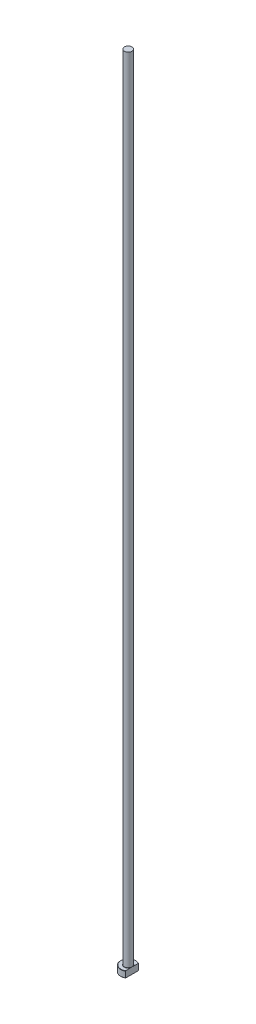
ISO-10303-21;
HEADER;
FILE_DESCRIPTION(('STEP AP214'),'2;1');
FILE_NAME('part.step','',(''),(''),'','','');
FILE_SCHEMA(('AUTOMOTIVE_DESIGN { 1 0 10303 214 1 1 1 1 }'));
ENDSEC;
DATA;
#1=APPLICATION_CONTEXT('core data for automotive mechanical design processes');
#2=APPLICATION_PROTOCOL_DEFINITION('international standard','automotive_design',2000,#1);
#3=PRODUCT_CONTEXT('',#1,'mechanical');
#4=PRODUCT('Part','Part','',(#3));
#5=PRODUCT_RELATED_PRODUCT_CATEGORY('part','',(#4));
#6=PRODUCT_DEFINITION_FORMATION('','',#4);
#7=PRODUCT_DEFINITION_CONTEXT('part definition',#1,'design');
#8=PRODUCT_DEFINITION('design','',#6,#7);
#9=PRODUCT_DEFINITION_SHAPE('','',#8);
#10=(LENGTH_UNIT() NAMED_UNIT(*) SI_UNIT(.MILLI.,.METRE.));
#11=(NAMED_UNIT(*) PLANE_ANGLE_UNIT() SI_UNIT($,.RADIAN.));
#12=(NAMED_UNIT(*) SI_UNIT($,.STERADIAN.) SOLID_ANGLE_UNIT());
#13=UNCERTAINTY_MEASURE_WITH_UNIT(LENGTH_MEASURE(1.E-05),#10,'distance_accuracy_value','');
#14=(GEOMETRIC_REPRESENTATION_CONTEXT(3) GLOBAL_UNCERTAINTY_ASSIGNED_CONTEXT((#13)) GLOBAL_UNIT_ASSIGNED_CONTEXT((#10,
#11,#12)) REPRESENTATION_CONTEXT('',''));
#15=CARTESIAN_POINT('',(0.,0.,0.));
#16=DIRECTION('',(0.,0.,1.));
#17=DIRECTION('',(1.,0.,0.));
#18=AXIS2_PLACEMENT_3D('',#15,#16,#17);
#19=CARTESIAN_POINT('',(0.,0.,0.));
#20=DIRECTION('',(0.,-1.,0.));
#21=DIRECTION('',(0.,0.,-1.));
#22=AXIS2_PLACEMENT_3D('',#19,#20,#21);
#23=PLANE('',#22);
#24=CARTESIAN_POINT('',(0.,0.,0.));
#25=DIRECTION('',(0.,-1.,0.));
#26=DIRECTION('',(0.,0.,-1.));
#27=AXIS2_PLACEMENT_3D('',#24,#25,#26);
#28=CIRCLE('',#27,5.79999999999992);
#29=CARTESIAN_POINT('',(2.99999999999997,0.,4.96386945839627));
#30=VERTEX_POINT('',#29);
#31=CARTESIAN_POINT('',(2.99999999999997,0.,-4.96386945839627));
#32=VERTEX_POINT('',#31);
#33=EDGE_CURVE('E98',#30,#32,#28,.T.);
#34=ORIENTED_EDGE('',*,*,#33,.T.);
#35=DIRECTION('',(0.,0.,1.));
#36=VECTOR('',#35,1.);
#37=CARTESIAN_POINT('',(2.99999999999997,0.,-5.19615242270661));
#38=LINE('',#37,#36);
#39=EDGE_CURVE('E83',#32,#30,#38,.T.);
#40=ORIENTED_EDGE('',*,*,#39,.T.);
#41=EDGE_LOOP('',(#34,#40));
#42=FACE_BOUND('',#41,.T.);
#43=ADVANCED_FACE('F32',(#42),#23,.T.);
#44=CARTESIAN_POINT('',(0.,259.958771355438,0.));
#45=DIRECTION('',(0.,1.,0.));
#46=DIRECTION('',(0.,0.,1.));
#47=AXIS2_PLACEMENT_3D('',#44,#45,#46);
#48=CYLINDRICAL_SURFACE('',#47,5.99999999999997);
#49=CARTESIAN_POINT('',(0.,4.80000000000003,0.));
#50=DIRECTION('',(0.,1.,0.));
#51=DIRECTION('',(0.,0.,1.));
#52=AXIS2_PLACEMENT_3D('',#49,#50,#51);
#53=CIRCLE('',#52,5.99999999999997);
#54=CARTESIAN_POINT('',(2.99999999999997,4.80000000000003,5.19615242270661));
#55=VERTEX_POINT('',#54);
#56=CARTESIAN_POINT('',(2.99999999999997,4.80000000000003,-5.19615242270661));
#57=VERTEX_POINT('',#56);
#58=EDGE_CURVE('E104',#55,#57,#53,.F.);
#59=ORIENTED_EDGE('',*,*,#58,.T.);
#60=DIRECTION('',(0.,-1.,0.));
#61=VECTOR('',#60,1.);
#62=CARTESIAN_POINT('',(2.99999999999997,630.,-5.19615242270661));
#63=LINE('',#62,#61);
#64=CARTESIAN_POINT('',(2.99999999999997,0.200000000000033,-5.19615242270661));
#65=VERTEX_POINT('',#64);
#66=EDGE_CURVE('E183',#57,#65,#63,.T.);
#67=ORIENTED_EDGE('',*,*,#66,.T.);
#68=CARTESIAN_POINT('',(0.,0.200000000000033,0.));
#69=DIRECTION('',(0.,-1.,0.));
#70=DIRECTION('',(0.,0.,-1.));
#71=AXIS2_PLACEMENT_3D('',#68,#69,#70);
#72=CIRCLE('',#71,5.99999999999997);
#73=CARTESIAN_POINT('',(2.99999999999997,0.200000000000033,5.19615242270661));
#74=VERTEX_POINT('',#73);
#75=EDGE_CURVE('E100',#65,#74,#72,.F.);
#76=ORIENTED_EDGE('',*,*,#75,.T.);
#77=DIRECTION('',(0.,-1.,0.));
#78=VECTOR('',#77,1.);
#79=CARTESIAN_POINT('',(2.99999999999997,630.,5.19615242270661));
#80=LINE('',#79,#78);
#81=EDGE_CURVE('E93',#55,#74,#80,.T.);
#82=ORIENTED_EDGE('',*,*,#81,.F.);
#83=EDGE_LOOP('',(#59,#67,#76,#82));
#84=FACE_BOUND('',#83,.T.);
#85=ADVANCED_FACE('F158',(#84),#48,.T.);
#86=CARTESIAN_POINT('',(-5.99999999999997,5.,0.));
#87=DIRECTION('',(0.,1.,0.));
#88=DIRECTION('',(0.,0.,1.));
#89=AXIS2_PLACEMENT_3D('',#86,#87,#88);
#90=PLANE('',#89);
#91=CARTESIAN_POINT('',(0.,5.,0.));
#92=DIRECTION('',(0.,1.,0.));
#93=DIRECTION('',(0.,0.,1.));
#94=AXIS2_PLACEMENT_3D('',#91,#92,#93);
#95=CIRCLE('',#94,5.79999999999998);
#96=CARTESIAN_POINT('',(2.99999999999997,5.,-4.96386945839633));
#97=VERTEX_POINT('',#96);
#98=CARTESIAN_POINT('',(2.99999999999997,5.,4.96386945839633));
#99=VERTEX_POINT('',#98);
#100=EDGE_CURVE('E178',#97,#99,#95,.T.);
#101=ORIENTED_EDGE('',*,*,#100,.T.);
#102=DIRECTION('',(0.,0.,-1.));
#103=VECTOR('',#102,1.);
#104=CARTESIAN_POINT('',(2.99999999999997,5.,0.));
#105=LINE('',#104,#103);
#106=CARTESIAN_POINT('',(2.99999999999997,4.99999999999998,1.11355287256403));
#107=VERTEX_POINT('',#106);
#108=EDGE_CURVE('E57',#99,#107,#105,.T.);
#109=ORIENTED_EDGE('',*,*,#108,.T.);
#110=CARTESIAN_POINT('',(0.,5.,0.));
#111=DIRECTION('',(0.,1.,0.));
#112=DIRECTION('',(0.,0.,1.));
#113=AXIS2_PLACEMENT_3D('',#110,#111,#112);
#114=CIRCLE('',#113,3.19999999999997);
#115=CARTESIAN_POINT('',(2.99999999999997,4.99999999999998,-1.113552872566));
#116=VERTEX_POINT('',#115);
#117=EDGE_CURVE('E107',#107,#116,#114,.F.);
#118=ORIENTED_EDGE('',*,*,#117,.T.);
#119=EDGE_CURVE('E136',#116,#97,#105,.T.);
#120=ORIENTED_EDGE('',*,*,#119,.T.);
#121=EDGE_LOOP('',(#101,#109,#118,#120));
#122=FACE_BOUND('',#121,.T.);
#123=ADVANCED_FACE('F147',(#122),#90,.T.);
#124=CARTESIAN_POINT('',(0.,5.,0.));
#125=DIRECTION('',(0.,-1.,0.));
#126=DIRECTION('',(0.,0.,-1.));
#127=AXIS2_PLACEMENT_3D('',#124,#125,#126);
#128=CONICAL_SURFACE('',#127,5.79999999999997,0.785398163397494);
#129=ORIENTED_EDGE('',*,*,#58,.F.);
#130=CARTESIAN_POINT('',(2.99999999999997,-1.01993959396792,11.432889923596));
#131=CARTESIAN_POINT('',(2.99999999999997,-0.769424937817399,11.1738796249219));
#132=CARTESIAN_POINT('',(2.99999999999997,-0.519179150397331,10.9146084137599));
#133=CARTESIAN_POINT('',(2.99999999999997,-0.0193842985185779,10.395389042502));
#134=CARTESIAN_POINT('',(2.99999999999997,0.230164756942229,10.1354408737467));
#135=CARTESIAN_POINT('',(2.99999999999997,0.728528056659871,9.61458602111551));
#136=CARTESIAN_POINT('',(2.99999999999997,0.977341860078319,9.35367891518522));
#137=CARTESIAN_POINT('',(2.99999999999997,1.47386965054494,8.83082274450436));
#138=CARTESIAN_POINT('',(2.99999999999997,1.72158364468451,8.56887368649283));
#139=CARTESIAN_POINT('',(2.99999999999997,2.21069282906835,8.04884148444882));
#140=CARTESIAN_POINT('',(2.99999999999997,2.4521159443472,7.79078462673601));
#141=CARTESIAN_POINT('',(2.99999999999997,2.93315589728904,7.27299342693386));
#142=CARTESIAN_POINT('',(2.99999999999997,3.17277274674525,7.01325909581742));
#143=CARTESIAN_POINT('',(2.99999999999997,3.64950020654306,6.49159990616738));
#144=CARTESIAN_POINT('',(2.99999999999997,3.88661134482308,6.22967553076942));
#145=CARTESIAN_POINT('',(2.99999999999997,4.35738571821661,5.70275148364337));
#146=CARTESIAN_POINT('',(2.99999999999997,4.59104909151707,5.43775193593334));
#147=CARTESIAN_POINT('',(2.99999999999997,4.96416348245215,5.00636825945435));
#148=CARTESIAN_POINT('',(2.99999999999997,5.1052013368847,4.8413584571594));
#149=CARTESIAN_POINT('',(2.99999999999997,5.38476673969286,4.50919282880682));
#150=CARTESIAN_POINT('',(2.99999999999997,5.52329404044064,4.34203679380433));
#151=CARTESIAN_POINT('',(2.99999999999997,5.79842961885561,4.0031993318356));
#152=CARTESIAN_POINT('',(2.99999999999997,5.93500216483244,3.83148875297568));
#153=CARTESIAN_POINT('',(2.99999999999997,6.20336281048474,3.4844211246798));
#154=CARTESIAN_POINT('',(2.99999999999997,6.33515205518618,3.30906496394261));
#155=CARTESIAN_POINT('',(2.99999999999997,6.5939338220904,2.9507080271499));
#156=CARTESIAN_POINT('',(2.99999999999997,6.72082315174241,2.76763161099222));
#157=CARTESIAN_POINT('',(2.99999999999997,6.90336321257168,2.48771743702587));
#158=CARTESIAN_POINT('',(2.99999999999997,6.96295431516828,2.39345390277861));
#159=CARTESIAN_POINT('',(2.99999999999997,7.07882720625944,2.20292146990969));
#160=CARTESIAN_POINT('',(2.99999999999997,7.13510937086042,2.10665280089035));
#161=CARTESIAN_POINT('',(2.99999999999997,7.24288059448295,1.91297779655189));
#162=CARTESIAN_POINT('',(2.99999999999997,7.29441986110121,1.81559978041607));
#163=CARTESIAN_POINT('',(2.99999999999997,7.39241237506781,1.61833215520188));
#164=CARTESIAN_POINT('',(2.99999999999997,7.43886469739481,1.51844209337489));
#165=CARTESIAN_POINT('',(2.99999999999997,7.56840030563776,1.21511948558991));
#166=CARTESIAN_POINT('',(2.99999999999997,7.64209011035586,1.00730397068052));
#167=CARTESIAN_POINT('',(2.99999999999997,7.72186700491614,0.695731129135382));
#168=CARTESIAN_POINT('',(2.99999999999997,7.74302901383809,0.595791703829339));
#169=CARTESIAN_POINT('',(2.99999999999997,7.77582528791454,0.394325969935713));
#170=CARTESIAN_POINT('',(2.99999999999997,7.78746040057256,0.292799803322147));
#171=CARTESIAN_POINT('',(2.99999999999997,7.80037895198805,0.0893987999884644));
#172=CARTESIAN_POINT('',(2.99999999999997,7.80169449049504,-0.0124739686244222));
#173=CARTESIAN_POINT('',(2.99999999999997,7.79396363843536,-0.215826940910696));
#174=CARTESIAN_POINT('',(2.99999999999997,7.78491639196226,-0.317307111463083));
#175=CARTESIAN_POINT('',(2.99999999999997,7.75721241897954,-0.518039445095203));
#176=CARTESIAN_POINT('',(2.99999999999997,7.73863812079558,-0.61730321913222));
#177=CARTESIAN_POINT('',(2.99999999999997,7.6930395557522,-0.813850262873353));
#178=CARTESIAN_POINT('',(2.99999999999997,7.66601427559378,-0.911133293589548));
#179=CARTESIAN_POINT('',(2.99999999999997,7.60464499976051,-1.10394843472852));
#180=CARTESIAN_POINT('',(2.99999999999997,7.57025976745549,-1.19946724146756));
#181=CARTESIAN_POINT('',(2.99999999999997,7.4955576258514,-1.38810736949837));
#182=CARTESIAN_POINT('',(2.99999999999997,7.45524192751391,-1.48122917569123));
#183=CARTESIAN_POINT('',(2.99999999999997,7.36961028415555,-1.66561491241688));
#184=CARTESIAN_POINT('',(2.99999999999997,7.32427350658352,-1.75686908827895));
#185=CARTESIAN_POINT('',(2.99999999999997,7.22966073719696,-1.93732130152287));
#186=CARTESIAN_POINT('',(2.99999999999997,7.18038388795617,-2.02651888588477));
#187=CARTESIAN_POINT('',(2.99999999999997,7.02771106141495,-2.29153460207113));
#188=CARTESIAN_POINT('',(2.99999999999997,6.91955486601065,-2.46460625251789));
#189=CARTESIAN_POINT('',(2.99999999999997,6.69440299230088,-2.80577028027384));
#190=CARTESIAN_POINT('',(2.99999999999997,6.57737415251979,-2.97384034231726));
#191=CARTESIAN_POINT('',(2.99999999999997,6.33748949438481,-3.30561771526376));
#192=CARTESIAN_POINT('',(2.99999999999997,6.21463662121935,-3.46932716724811));
#193=CARTESIAN_POINT('',(2.99999999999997,5.96308085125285,-3.79561670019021));
#194=CARTESIAN_POINT('',(2.99999999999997,5.83432224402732,-3.95815356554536));
#195=CARTESIAN_POINT('',(2.99999999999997,5.57361365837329,-4.28066737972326));
#196=CARTESIAN_POINT('',(2.99999999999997,5.44166333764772,-4.44064405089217));
#197=CARTESIAN_POINT('',(2.99999999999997,5.17568445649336,-4.75819552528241));
#198=CARTESIAN_POINT('',(2.99999999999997,5.04166171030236,-4.91577521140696));
#199=CARTESIAN_POINT('',(2.99999999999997,4.77176230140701,-5.22934053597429));
#200=CARTESIAN_POINT('',(2.99999999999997,4.63588560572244,-5.38532614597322));
#201=CARTESIAN_POINT('',(2.99999999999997,4.27256222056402,-5.79849838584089));
#202=CARTESIAN_POINT('',(2.99999999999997,4.04384014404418,-6.054562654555));
#203=CARTESIAN_POINT('',(2.99999999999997,3.58360020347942,-6.5641703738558));
#204=CARTESIAN_POINT('',(2.99999999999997,3.35208226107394,-6.81771375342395));
#205=CARTESIAN_POINT('',(2.99999999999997,2.88678846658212,-7.32315936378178));
#206=CARTESIAN_POINT('',(2.99999999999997,2.65301069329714,-7.57505982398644));
#207=CARTESIAN_POINT('',(2.99999999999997,2.18392232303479,-8.07742926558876));
#208=CARTESIAN_POINT('',(2.99999999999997,1.94861172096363,-8.32789824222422));
#209=CARTESIAN_POINT('',(2.99999999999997,1.4865158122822,-8.81743943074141));
#210=CARTESIAN_POINT('',(2.99999999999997,1.25977806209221,-9.05655656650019));
#211=CARTESIAN_POINT('',(2.99999999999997,0.805439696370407,-9.53397105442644));
#212=CARTESIAN_POINT('',(2.99999999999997,0.577839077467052,-9.77226840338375));
#213=CARTESIAN_POINT('',(2.99999999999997,0.122198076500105,-10.2479325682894));
#214=CARTESIAN_POINT('',(2.99999999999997,-0.105841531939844,-10.4853001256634));
#215=CARTESIAN_POINT('',(2.99999999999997,-0.562491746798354,-10.9594816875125));
#216=CARTESIAN_POINT('',(2.99999999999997,-0.791102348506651,-11.1962956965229));
#217=CARTESIAN_POINT('',(2.99999999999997,-1.01993959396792,-11.432889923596));
#218=B_SPLINE_CURVE_WITH_KNOTS('',3,(#130,#131,#132,#133,#134,#135,#136,#137,#138,#139,#140,
#141,#142,#143,#144,#145,#146,#147,#148,#149,#150,#151,#152,#153,#154,#155,#156,#157,#158,#159,
#160,#161,#162,#163,#164,#165,#166,#167,#168,#169,#170,#171,#172,#173,#174,#175,#176,#177,#178,
#179,#180,#181,#182,#183,#184,#185,#186,#187,#188,#189,#190,#191,#192,#193,#194,#195,#196,#197,
#198,#199,#200,#201,#202,#203,#204,#205,#206,#207,#208,#209,#210,#211,#212,#213,#214,#215,#216,
#217),.UNSPECIFIED.,.F.,.F.,(4,2,2,2,2,2,2,2,2,2,2,2,2,2,2,2,2,2,2,2,2,2,2,2,2,2,2,2,2,2,2,2,2,
2,2,2,2,2,2,2,2,2,2,4),(0.,1.08101662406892,2.16204714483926,3.24363027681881,4.32520642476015,
5.3853446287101,6.44547590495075,7.50537917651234,8.56523985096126,9.21643479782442,
9.86769362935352,10.5258323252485,11.1838124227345,11.851781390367,12.1862877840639,
12.5207560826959,12.8511332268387,13.1815703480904,13.8399161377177,14.1460077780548,
14.4520721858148,14.7571841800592,15.0623213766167,15.3648619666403,15.6674388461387,
15.9717575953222,16.2760142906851,16.5815843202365,16.8872210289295,17.4990577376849,
18.1133060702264,18.7272470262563,19.3492675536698,19.9713550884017,20.5919343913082,
21.2125247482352,22.2425132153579,23.2725306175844,24.3035181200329,25.3345090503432,
26.3230827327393,27.3116602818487,28.299135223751,29.286602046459),.UNSPECIFIED.);
#219=EDGE_CURVE('E135',#55,#99,#218,.T.);
#220=ORIENTED_EDGE('',*,*,#219,.T.);
#221=ORIENTED_EDGE('',*,*,#100,.F.);
#222=EDGE_CURVE('E127',#97,#57,#218,.T.);
#223=ORIENTED_EDGE('',*,*,#222,.T.);
#224=EDGE_LOOP('',(#129,#220,#221,#223));
#225=FACE_BOUND('',#224,.T.);
#226=ADVANCED_FACE('F143',(#225),#128,.T.);
#227=CARTESIAN_POINT('',(0.,0.200000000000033,0.));
#228=DIRECTION('',(0.,1.,0.));
#229=DIRECTION('',(0.,0.,1.));
#230=AXIS2_PLACEMENT_3D('',#227,#228,#229);
#231=CONICAL_SURFACE('',#230,5.99999999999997,0.785398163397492);
#232=ORIENTED_EDGE('',*,*,#75,.F.);
#233=CARTESIAN_POINT('',(2.99999999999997,6.01993959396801,-11.432889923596));
#234=CARTESIAN_POINT('',(2.99999999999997,5.76942493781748,-11.1738796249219));
#235=CARTESIAN_POINT('',(2.99999999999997,5.51917915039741,-10.9146084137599));
#236=CARTESIAN_POINT('',(2.99999999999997,5.01938429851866,-10.395389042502));
#237=CARTESIAN_POINT('',(2.99999999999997,4.76983524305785,-10.1354408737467));
#238=CARTESIAN_POINT('',(2.99999999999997,4.2714719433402,-9.6145860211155));
#239=CARTESIAN_POINT('',(2.99999999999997,4.02265813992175,-9.35367891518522));
#240=CARTESIAN_POINT('',(2.99999999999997,3.52613034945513,-8.83082274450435));
#241=CARTESIAN_POINT('',(2.99999999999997,3.27841635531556,-8.56887368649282));
#242=CARTESIAN_POINT('',(2.99999999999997,2.78930717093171,-8.04884148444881));
#243=CARTESIAN_POINT('',(2.99999999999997,2.54788405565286,-7.790784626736));
#244=CARTESIAN_POINT('',(2.99999999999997,2.06684410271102,-7.27299342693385));
#245=CARTESIAN_POINT('',(2.99999999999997,1.82722725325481,-7.01325909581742));
#246=CARTESIAN_POINT('',(2.99999999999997,1.350499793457,-6.49159990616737));
#247=CARTESIAN_POINT('',(2.99999999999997,1.11338865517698,-6.22967553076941));
#248=CARTESIAN_POINT('',(2.99999999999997,0.64261428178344,-5.70275148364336));
#249=CARTESIAN_POINT('',(2.99999999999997,0.408950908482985,-5.43775193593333));
#250=CARTESIAN_POINT('',(2.99999999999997,0.0358365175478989,-5.00636825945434));
#251=CARTESIAN_POINT('',(2.99999999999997,-0.105201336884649,-4.84135845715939));
#252=CARTESIAN_POINT('',(2.99999999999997,-0.38476673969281,-4.50919282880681));
#253=CARTESIAN_POINT('',(2.99999999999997,-0.52329404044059,-4.34203679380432));
#254=CARTESIAN_POINT('',(2.99999999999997,-0.79842961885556,-4.0031993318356));
#255=CARTESIAN_POINT('',(2.99999999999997,-0.935002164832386,-3.83148875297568));
#256=CARTESIAN_POINT('',(2.99999999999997,-1.20336281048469,-3.48442112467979));
#257=CARTESIAN_POINT('',(2.99999999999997,-1.33515205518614,-3.3090649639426));
#258=CARTESIAN_POINT('',(2.99999999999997,-1.59393382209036,-2.9507080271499));
#259=CARTESIAN_POINT('',(2.99999999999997,-1.72082315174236,-2.76763161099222));
#260=CARTESIAN_POINT('',(2.99999999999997,-1.90336321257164,-2.48771743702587));
#261=CARTESIAN_POINT('',(2.99999999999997,-1.96295431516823,-2.3934539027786));
#262=CARTESIAN_POINT('',(2.99999999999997,-2.07882720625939,-2.20292146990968));
#263=CARTESIAN_POINT('',(2.99999999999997,-2.13510937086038,-2.10665280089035));
#264=CARTESIAN_POINT('',(2.99999999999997,-2.2428805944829,-1.91297779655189));
#265=CARTESIAN_POINT('',(2.99999999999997,-2.29441986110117,-1.81559978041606));
#266=CARTESIAN_POINT('',(2.99999999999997,-2.39241237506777,-1.61833215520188));
#267=CARTESIAN_POINT('',(2.99999999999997,-2.43886469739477,-1.51844209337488));
#268=CARTESIAN_POINT('',(2.99999999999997,-2.56840030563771,-1.2151194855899));
#269=CARTESIAN_POINT('',(2.99999999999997,-2.64209011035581,-1.00730397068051));
#270=CARTESIAN_POINT('',(2.99999999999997,-2.72186700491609,-0.695731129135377));
#271=CARTESIAN_POINT('',(2.99999999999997,-2.74302901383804,-0.595791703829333));
#272=CARTESIAN_POINT('',(2.99999999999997,-2.77582528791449,-0.394325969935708));
#273=CARTESIAN_POINT('',(2.99999999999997,-2.78746040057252,-0.292799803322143));
#274=CARTESIAN_POINT('',(2.99999999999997,-2.800378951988,-0.0893987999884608));
#275=CARTESIAN_POINT('',(2.99999999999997,-2.80169449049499,0.0124739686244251));
#276=CARTESIAN_POINT('',(2.99999999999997,-2.79396363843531,0.215826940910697));
#277=CARTESIAN_POINT('',(2.99999999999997,-2.78491639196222,0.317307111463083));
#278=CARTESIAN_POINT('',(2.99999999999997,-2.7572124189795,0.518039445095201));
#279=CARTESIAN_POINT('',(2.99999999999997,-2.73863812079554,0.617303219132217));
#280=CARTESIAN_POINT('',(2.99999999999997,-2.69303955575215,0.813850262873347));
#281=CARTESIAN_POINT('',(2.99999999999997,-2.66601427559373,0.911133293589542));
#282=CARTESIAN_POINT('',(2.99999999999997,-2.60464499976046,1.10394843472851));
#283=CARTESIAN_POINT('',(2.99999999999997,-2.57025976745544,1.19946724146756));
#284=CARTESIAN_POINT('',(2.99999999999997,-2.49555762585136,1.38810736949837));
#285=CARTESIAN_POINT('',(2.99999999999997,-2.45524192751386,1.48122917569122));
#286=CARTESIAN_POINT('',(2.99999999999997,-2.3696102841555,1.66561491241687));
#287=CARTESIAN_POINT('',(2.99999999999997,-2.32427350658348,1.75686908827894));
#288=CARTESIAN_POINT('',(2.99999999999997,-2.22966073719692,1.93732130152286));
#289=CARTESIAN_POINT('',(2.99999999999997,-2.18038388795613,2.02651888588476));
#290=CARTESIAN_POINT('',(2.99999999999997,-2.02771106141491,2.29153460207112));
#291=CARTESIAN_POINT('',(2.99999999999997,-1.91955486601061,2.46460625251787));
#292=CARTESIAN_POINT('',(2.99999999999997,-1.69440299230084,2.80577028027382));
#293=CARTESIAN_POINT('',(2.99999999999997,-1.57737415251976,2.97384034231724));
#294=CARTESIAN_POINT('',(2.99999999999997,-1.33748949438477,3.30561771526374));
#295=CARTESIAN_POINT('',(2.99999999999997,-1.21463662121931,3.46932716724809));
#296=CARTESIAN_POINT('',(2.99999999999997,-0.963080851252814,3.79561670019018));
#297=CARTESIAN_POINT('',(2.99999999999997,-0.834322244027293,3.95815356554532));
#298=CARTESIAN_POINT('',(2.99999999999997,-0.573613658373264,4.28066737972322));
#299=CARTESIAN_POINT('',(2.99999999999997,-0.441663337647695,4.44064405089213));
#300=CARTESIAN_POINT('',(2.99999999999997,-0.175684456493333,4.75819552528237));
#301=CARTESIAN_POINT('',(2.99999999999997,-0.0416617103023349,4.91577521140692));
#302=CARTESIAN_POINT('',(2.99999999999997,0.22823769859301,5.22934053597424));
#303=CARTESIAN_POINT('',(2.99999999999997,0.364114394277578,5.38532614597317));
#304=CARTESIAN_POINT('',(2.99999999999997,0.727437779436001,5.79849838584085));
#305=CARTESIAN_POINT('',(2.99999999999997,0.956159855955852,6.05456265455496));
#306=CARTESIAN_POINT('',(2.99999999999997,1.41639979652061,6.56417037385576));
#307=CARTESIAN_POINT('',(2.99999999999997,1.64791773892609,6.81771375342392));
#308=CARTESIAN_POINT('',(2.99999999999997,2.11321153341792,7.32315936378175));
#309=CARTESIAN_POINT('',(2.99999999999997,2.3469893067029,7.57505982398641));
#310=CARTESIAN_POINT('',(2.99999999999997,2.81607767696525,8.07742926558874));
#311=CARTESIAN_POINT('',(2.99999999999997,3.05138827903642,8.3278982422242));
#312=CARTESIAN_POINT('',(2.99999999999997,3.51348418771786,8.81743943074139));
#313=CARTESIAN_POINT('',(2.99999999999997,3.74022193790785,9.05655656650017));
#314=CARTESIAN_POINT('',(2.99999999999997,4.19456030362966,9.53397105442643));
#315=CARTESIAN_POINT('',(2.99999999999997,4.42216092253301,9.77226840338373));
#316=CARTESIAN_POINT('',(2.99999999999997,4.87780192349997,10.2479325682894));
#317=CARTESIAN_POINT('',(2.99999999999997,5.10584153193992,10.4853001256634));
#318=CARTESIAN_POINT('',(2.99999999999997,5.56249174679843,10.9594816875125));
#319=CARTESIAN_POINT('',(2.99999999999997,5.79110234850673,11.1962956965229));
#320=CARTESIAN_POINT('',(2.99999999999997,6.01993959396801,11.432889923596));
#321=B_SPLINE_CURVE_WITH_KNOTS('',3,(#233,#234,#235,#236,#237,#238,#239,#240,#241,#242,#243,
#244,#245,#246,#247,#248,#249,#250,#251,#252,#253,#254,#255,#256,#257,#258,#259,#260,#261,#262,
#263,#264,#265,#266,#267,#268,#269,#270,#271,#272,#273,#274,#275,#276,#277,#278,#279,#280,#281,
#282,#283,#284,#285,#286,#287,#288,#289,#290,#291,#292,#293,#294,#295,#296,#297,#298,#299,#300,
#301,#302,#303,#304,#305,#306,#307,#308,#309,#310,#311,#312,#313,#314,#315,#316,#317,#318,#319,
#320),.UNSPECIFIED.,.F.,.F.,(4,2,2,2,2,2,2,2,2,2,2,2,2,2,2,2,2,2,2,2,2,2,2,2,2,2,2,2,2,2,2,2,2,
2,2,2,2,2,2,2,2,2,2,4),(0.,1.08101662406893,2.16204714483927,3.24363027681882,4.32520642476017,
5.38534462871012,6.44547590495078,7.50537917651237,8.5652398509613,9.21643479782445,
9.86769362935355,10.5258323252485,11.1838124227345,11.851781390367,12.186287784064,
12.5207560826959,12.8511332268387,13.1815703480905,13.8399161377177,14.1460077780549,
14.4520721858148,14.7571841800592,15.0623213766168,15.3648619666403,15.6674388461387,
15.9717575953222,16.2760142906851,16.5815843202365,16.8872210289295,17.4990577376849,
18.1133060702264,18.7272470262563,19.3492675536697,19.9713550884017,20.5919343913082,
21.2125247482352,22.2425132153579,23.2725306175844,24.3035181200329,25.3345090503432,
26.3230827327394,27.3116602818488,28.299135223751,29.2866020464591),.UNSPECIFIED.);
#322=EDGE_CURVE('E86',#65,#32,#321,.T.);
#323=ORIENTED_EDGE('',*,*,#322,.T.);
#324=ORIENTED_EDGE('',*,*,#33,.F.);
#325=EDGE_CURVE('E89',#30,#74,#321,.T.);
#326=ORIENTED_EDGE('',*,*,#325,.T.);
#327=EDGE_LOOP('',(#232,#323,#324,#326));
#328=FACE_BOUND('',#327,.T.);
#329=ADVANCED_FACE('F97',(#328),#231,.T.);
#330=CARTESIAN_POINT('',(0.,5.19999999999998,0.));
#331=DIRECTION('',(0.,1.,0.));
#332=DIRECTION('',(0.,0.,1.));
#333=AXIS2_PLACEMENT_3D('',#330,#331,#332);
#334=TOROIDAL_SURFACE('',#333,3.19999999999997,0.2);
#335=CARTESIAN_POINT('',(2.99999999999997,5.19999999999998,0.));
#336=CARTESIAN_POINT('',(2.99999999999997,5.20000054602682,-8.25589702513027E-09));
#337=CARTESIAN_POINT('',(2.99999999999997,5.20000108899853,-2.22623702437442E-07));
#338=CARTESIAN_POINT('',(2.99999999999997,5.20000210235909,-8.13181300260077E-07));
#339=CARTESIAN_POINT('',(2.99999999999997,5.20000256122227,-1.20262206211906E-06));
#340=CARTESIAN_POINT('',(2.99999999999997,5.20000351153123,-2.13233189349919E-06));
#341=CARTESIAN_POINT('',(2.99999999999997,5.2000039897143,-2.68711073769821E-06));
#342=CARTESIAN_POINT('',(2.99999999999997,5.20000484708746,-3.83722986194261E-06));
#343=CARTESIAN_POINT('',(2.99999999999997,5.20000522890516,-4.43075968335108E-06));
#344=CARTESIAN_POINT('',(2.99999999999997,5.20000663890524,-6.71805399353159E-06));
#345=CARTESIAN_POINT('',(2.99999999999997,5.20000758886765,-8.46267320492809E-06));
#346=CARTESIAN_POINT('',(2.99999999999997,5.20000915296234,-1.19195937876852E-05));
#347=CARTESIAN_POINT('',(2.99999999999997,5.20000978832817,-1.36226966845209E-05));
#348=CARTESIAN_POINT('',(2.99999999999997,5.20001243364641,-2.07785327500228E-05));
#349=CARTESIAN_POINT('',(2.99999999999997,5.20001439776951,-2.62512686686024E-05));
#350=CARTESIAN_POINT('',(2.99999999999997,5.20001730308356,-3.65971251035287E-05));
#351=CARTESIAN_POINT('',(2.99999999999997,5.20001835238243,-4.14397201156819E-05));
#352=CARTESIAN_POINT('',(2.99999999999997,5.20002589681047,-7.68826107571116E-05));
#353=CARTESIAN_POINT('',(2.99999999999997,5.20003169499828,-0.000107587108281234));
#354=CARTESIAN_POINT('',(2.99999999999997,5.20005649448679,-0.000225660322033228));
#355=CARTESIAN_POINT('',(2.99999999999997,5.2000799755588,-0.000312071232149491));
#356=CARTESIAN_POINT('',(2.99999999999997,5.2001671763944,-0.000638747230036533));
#357=CARTESIAN_POINT('',(2.99999999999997,5.20022823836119,-0.000879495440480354));
#358=CARTESIAN_POINT('',(2.99999999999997,5.20046253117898,-0.00179757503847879));
#359=CARTESIAN_POINT('',(2.99999999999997,5.20063826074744,-0.00247448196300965));
#360=CARTESIAN_POINT('',(2.99999999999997,5.20145771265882,-0.00563611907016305));
#361=CARTESIAN_POINT('',(2.99999999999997,5.20209802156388,-0.00812138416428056));
#362=CARTESIAN_POINT('',(2.99999999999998,5.207470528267,-0.0289666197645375));
#363=CARTESIAN_POINT('',(2.99999999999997,5.2122144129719,-0.0473249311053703));
#364=CARTESIAN_POINT('',(2.99999999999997,5.2215041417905,-0.0833908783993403));
#365=CARTESIAN_POINT('',(2.99999999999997,5.22605099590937,-0.101098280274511));
#366=CARTESIAN_POINT('',(2.99999999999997,5.24071513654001,-0.158441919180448));
#367=CARTESIAN_POINT('',(2.99999999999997,5.25076238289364,-0.198096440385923));
#368=CARTESIAN_POINT('',(2.99999999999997,5.26735876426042,-0.264903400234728));
#369=CARTESIAN_POINT('',(2.99999999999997,5.27400650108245,-0.292031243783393));
#370=CARTESIAN_POINT('',(2.99999999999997,5.28691139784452,-0.345693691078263));
#371=CARTESIAN_POINT('',(2.99999999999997,5.29317409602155,-0.372226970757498));
#372=CARTESIAN_POINT('',(2.99999999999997,5.31359314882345,-0.460847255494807));
#373=CARTESIAN_POINT('',(2.99999999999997,5.3271194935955,-0.52308420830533));
#374=CARTESIAN_POINT('',(2.99999999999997,5.35185224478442,-0.648627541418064));
#375=CARTESIAN_POINT('',(2.99999999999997,5.36303576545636,-0.711938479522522));
#376=CARTESIAN_POINT('',(2.99999999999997,5.382697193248,-0.845442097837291));
#377=CARTESIAN_POINT('',(2.99999999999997,5.39079783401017,-0.915695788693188));
#378=CARTESIAN_POINT('',(2.99999999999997,5.39788104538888,-1.02128246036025));
#379=CARTESIAN_POINT('',(2.99999999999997,5.399399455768,-1.05644278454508));
#380=CARTESIAN_POINT('',(2.99999999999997,5.40031405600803,-1.12678521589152));
#381=CARTESIAN_POINT('',(2.99999999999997,5.39971158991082,-1.16196729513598));
#382=CARTESIAN_POINT('',(2.99999999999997,5.39660553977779,-1.21713951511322));
#383=CARTESIAN_POINT('',(2.99999999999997,5.39502683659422,-1.23718181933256));
#384=CARTESIAN_POINT('',(2.99999999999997,5.39080008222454,-1.27717351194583));
#385=CARTESIAN_POINT('',(2.99999999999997,5.38815120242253,-1.29712281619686));
#386=CARTESIAN_POINT('',(2.99999999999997,5.38160570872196,-1.33655702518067));
#387=CARTESIAN_POINT('',(2.99999999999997,5.37772556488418,-1.35604460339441));
#388=CARTESIAN_POINT('',(2.99999999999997,5.36841119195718,-1.39463554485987));
#389=CARTESIAN_POINT('',(2.99999999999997,5.36297874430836,-1.41373932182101));
#390=CARTESIAN_POINT('',(2.99999999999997,5.3500393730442,-1.45151809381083));
#391=CARTESIAN_POINT('',(2.99999999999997,5.34250654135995,-1.47018435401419));
#392=CARTESIAN_POINT('',(2.99999999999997,5.32469433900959,-1.50617232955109));
#393=CARTESIAN_POINT('',(2.99999999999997,5.31442814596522,-1.52349999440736));
#394=CARTESIAN_POINT('',(2.99999999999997,5.29768486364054,-1.5453003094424));
#395=CARTESIAN_POINT('',(2.99999999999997,5.29285641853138,-1.551032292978));
#396=CARTESIAN_POINT('',(2.99999999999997,5.28257691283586,-1.56192749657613));
#397=CARTESIAN_POINT('',(2.99999999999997,5.27712536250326,-1.56709026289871));
#398=CARTESIAN_POINT('',(2.99999999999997,5.26548354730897,-1.57666725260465));
#399=CARTESIAN_POINT('',(2.99999999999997,5.25928560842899,-1.58107232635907));
#400=CARTESIAN_POINT('',(2.99999999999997,5.24620912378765,-1.5887219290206));
#401=CARTESIAN_POINT('',(2.99999999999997,5.23933242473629,-1.59196950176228));
#402=CARTESIAN_POINT('',(2.99999999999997,5.22702406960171,-1.5962468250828));
#403=CARTESIAN_POINT('',(2.99999999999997,5.2217197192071,-1.59764171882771));
#404=CARTESIAN_POINT('',(2.99999999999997,5.2109516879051,-1.59951721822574));
#405=CARTESIAN_POINT('',(2.99999999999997,5.20548813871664,-1.59999855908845));
#406=CARTESIAN_POINT('',(2.99999999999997,5.19455397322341,-1.60000143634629));
#407=CARTESIAN_POINT('',(2.99999999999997,5.18908335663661,-1.59952177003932));
#408=CARTESIAN_POINT('',(2.99999999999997,5.17830149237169,-1.59764696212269));
#409=CARTESIAN_POINT('',(2.99999999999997,5.17299036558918,-1.59625114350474));
#410=CARTESIAN_POINT('',(2.99999999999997,5.16137413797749,-1.5922159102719));
#411=CARTESIAN_POINT('',(2.99999999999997,5.15514663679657,-1.58935479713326));
#412=CARTESIAN_POINT('',(2.99999999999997,5.14323789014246,-1.58266473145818));
#413=CARTESIAN_POINT('',(2.99999999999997,5.13755768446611,-1.57883398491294));
#414=CARTESIAN_POINT('',(2.99999999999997,5.12388989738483,-1.5682309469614));
#415=CARTESIAN_POINT('',(2.99999999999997,5.11627920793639,-1.56097697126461));
#416=CARTESIAN_POINT('',(2.99999999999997,5.10222993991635,-1.54541986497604));
#417=CARTESIAN_POINT('',(2.99999999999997,5.09579438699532,-1.53711411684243));
#418=CARTESIAN_POINT('',(2.99999999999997,5.07874447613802,-1.51234359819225));
#419=CARTESIAN_POINT('',(2.99999999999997,5.06934681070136,-1.49505024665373));
#420=CARTESIAN_POINT('',(2.99999999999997,5.05300413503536,-1.45936637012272));
#421=CARTESIAN_POINT('',(2.99999999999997,5.04606563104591,-1.440973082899));
#422=CARTESIAN_POINT('',(2.99999999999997,5.03343712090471,-1.40170303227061));
#423=CARTESIAN_POINT('',(2.99999999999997,5.02794514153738,-1.38076360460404));
#424=CARTESIAN_POINT('',(2.99999999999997,5.01869119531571,-1.33849708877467));
#425=CARTESIAN_POINT('',(2.99999999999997,5.01493126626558,-1.31716957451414));
#426=CARTESIAN_POINT('',(2.99999999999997,5.00879575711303,-1.27427301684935));
#427=CARTESIAN_POINT('',(2.99999999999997,5.00642327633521,-1.25270354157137));
#428=CARTESIAN_POINT('',(2.99999999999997,5.00283272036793,-1.20948719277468));
#429=CARTESIAN_POINT('',(2.99999999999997,5.00161392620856,-1.18784037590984));
#430=CARTESIAN_POINT('',(2.99999999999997,4.99921193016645,-1.11739576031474));
#431=CARTESIAN_POINT('',(2.99999999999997,4.99998309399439,-1.06853061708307));
#432=CARTESIAN_POINT('',(2.99999999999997,5.00498456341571,-0.970964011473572));
#433=CARTESIAN_POINT('',(2.99999999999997,5.00921876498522,-0.922262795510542));
#434=CARTESIAN_POINT('',(2.99999999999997,5.02027934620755,-0.825023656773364));
#435=CARTESIAN_POINT('',(2.99999999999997,5.02711306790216,-0.776486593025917));
#436=CARTESIAN_POINT('',(2.99999999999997,5.04272509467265,-0.679720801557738));
#437=CARTESIAN_POINT('',(2.99999999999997,5.05150395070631,-0.631492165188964));
#438=CARTESIAN_POINT('',(2.99999999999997,5.07999589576,-0.487173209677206));
#439=CARTESIAN_POINT('',(2.99999999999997,5.10185558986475,-0.391514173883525));
#440=CARTESIAN_POINT('',(2.99999999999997,5.14819769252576,-0.200831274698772));
#441=CARTESIAN_POINT('',(2.99999999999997,5.17268119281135,-0.105807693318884));
#442=CARTESIAN_POINT('',(2.99999999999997,5.19722910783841,-0.0107318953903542));
#443=CARTESIAN_POINT('',(2.99999999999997,5.19724528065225,-0.0106692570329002));
#444=CARTESIAN_POINT('',(2.99999999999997,5.19781243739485,-0.00847232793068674));
#445=CARTESIAN_POINT('',(2.99999999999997,5.19836102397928,-0.00633759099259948));
#446=CARTESIAN_POINT('',(2.99999999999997,5.1991597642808,-0.00325873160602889));
#447=CARTESIAN_POINT('',(2.99999999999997,5.19940591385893,-0.00231386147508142));
#448=CARTESIAN_POINT('',(2.99999999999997,5.19972567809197,-0.00105818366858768));
#449=CARTESIAN_POINT('',(2.99999999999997,5.19980400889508,-0.000748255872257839));
#450=CARTESIAN_POINT('',(2.99999999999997,5.1999122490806,-0.000340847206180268));
#451=CARTESIAN_POINT('',(2.99999999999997,5.19993871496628,-0.000242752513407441));
#452=CARTESIAN_POINT('',(2.99999999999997,5.19996623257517,-0.000111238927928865));
#453=CARTESIAN_POINT('',(2.99999999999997,5.19997237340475,-7.89037769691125E-05));
#454=CARTESIAN_POINT('',(2.99999999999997,5.19998062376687,-4.17973012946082E-05));
#455=CARTESIAN_POINT('',(2.99999999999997,5.19998174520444,-3.68646325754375E-05));
#456=CARTESIAN_POINT('',(2.99999999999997,5.19998486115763,-2.6333709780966E-05));
#457=CARTESIAN_POINT('',(2.99999999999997,5.19998697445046,-2.0770778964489E-05));
#458=CARTESIAN_POINT('',(2.99999999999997,5.19998981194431,-1.35213137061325E-05));
#459=CARTESIAN_POINT('',(2.99999999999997,5.19999048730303,-1.18115060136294E-05));
#460=CARTESIAN_POINT('',(2.99999999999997,5.19999214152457,-8.34771962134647E-06));
#461=CARTESIAN_POINT('',(2.99999999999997,5.19999314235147,-6.60378870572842E-06));
#462=CARTESIAN_POINT('',(2.99999999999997,5.1999946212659,-4.32501646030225E-06));
#463=CARTESIAN_POINT('',(2.99999999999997,5.1999950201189,-3.73587510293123E-06));
#464=CARTESIAN_POINT('',(2.99999999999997,5.19999591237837,-2.59760768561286E-06));
#465=CARTESIAN_POINT('',(2.99999999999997,5.19999640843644,-2.05040430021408E-06));
#466=CARTESIAN_POINT('',(2.99999999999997,5.19999738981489,-1.1384674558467E-06));
#467=CARTESIAN_POINT('',(2.99999999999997,5.19999786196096,-7.58552551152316E-07));
#468=CARTESIAN_POINT('',(2.99999999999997,5.19999889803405,-1.92079005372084E-07));
#469=CARTESIAN_POINT('',(2.99999999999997,5.19999945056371,8.30744745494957E-09));
#470=CARTESIAN_POINT('',(2.99999999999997,5.19999999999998,0.));
#471=B_SPLINE_CURVE_WITH_KNOTS('',3,(#335,#336,#337,#338,#339,#340,#341,#342,#343,#344,#345,
#346,#347,#348,#349,#350,#351,#352,#353,#354,#355,#356,#357,#358,#359,#360,#361,#362,#363,#364,
#365,#366,#367,#368,#369,#370,#371,#372,#373,#374,#375,#376,#377,#378,#379,#380,#381,#382,#383,
#384,#385,#386,#387,#388,#389,#390,#391,#392,#393,#394,#395,#396,#397,#398,#399,#400,#401,#402,
#403,#404,#405,#406,#407,#408,#409,#410,#411,#412,#413,#414,#415,#416,#417,#418,#419,#420,#421,
#422,#423,#424,#425,#426,#427,#428,#429,#430,#431,#432,#433,#434,#435,#436,#437,#438,#439,#440,
#441,#442,#443,#444,#445,#446,#447,#448,#449,#450,#451,#452,#453,#454,#455,#456,#457,#458,#459,
#460,#461,#462,#463,#464,#465,#466,#467,#468,#469,#470),.UNSPECIFIED.,.T.,.F.,(4,2,2,2,2,2,2,2,
2,2,2,2,2,2,2,2,2,2,2,2,2,2,2,2,2,2,2,2,2,2,2,2,2,2,2,2,2,2,2,2,2,2,2,2,2,2,2,2,2,2,2,2,2,2,2,2,
2,2,2,2,2,2,2,2,2,2,2,4),(0.,1.65204701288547E-06,3.45848810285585E-06,5.64280272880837E-06,
7.75882449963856E-06,1.36969712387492E-05,1.9145444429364E-05,3.65603925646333E-05,
5.14083087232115E-05,0.000145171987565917,0.000413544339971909,0.00115890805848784,
0.00325667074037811,0.0109563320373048,0.067838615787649,0.122684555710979,0.245405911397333,
0.329196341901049,0.410983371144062,0.602016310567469,0.79483628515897,1.00673763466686,
1.11227258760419,1.21774067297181,1.27803175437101,1.33836960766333,1.39793215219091,
1.45742661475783,1.51769013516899,1.57766822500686,1.60011625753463,1.62258205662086,
1.64530254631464,1.66796284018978,1.68434680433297,1.70071757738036,1.71710885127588,
1.7335122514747,1.75395806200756,1.77444198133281,1.8058056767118,1.83724902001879,
1.89596356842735,1.95483231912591,2.01967230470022,2.08458838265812,2.14964892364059,
2.21466889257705,2.3610799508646,2.50765595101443,2.65464904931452,2.80168383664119,
3.09594779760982,3.39033467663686,3.39052875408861,3.3971415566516,3.40007033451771,
3.40102967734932,3.4013342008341,3.40143296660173,3.40144812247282,3.40146594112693,
3.40147145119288,3.401477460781,3.40147959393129,3.40148179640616,3.40148361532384,
3.40148527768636),.UNSPECIFIED.);
#472=CARTESIAN_POINT('',(2.99999999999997,5.19999999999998,0.));
#473=VERTEX_POINT('',#472);
#474=EDGE_CURVE('E11',#116,#473,#471,.T.);
#475=ORIENTED_EDGE('',*,*,#474,.F.);
#476=ORIENTED_EDGE('',*,*,#117,.F.);
#477=CARTESIAN_POINT('',(2.99999999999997,5.19999999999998,0.));
#478=CARTESIAN_POINT('',(2.99999999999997,5.19999945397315,8.25589702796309E-09));
#479=CARTESIAN_POINT('',(2.99999999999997,5.19999891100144,2.22623702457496E-07));
#480=CARTESIAN_POINT('',(2.99999999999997,5.19999789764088,8.13181300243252E-07));
#481=CARTESIAN_POINT('',(2.99999999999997,5.19999743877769,1.20262206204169E-06));
#482=CARTESIAN_POINT('',(2.99999999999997,5.19999648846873,2.13233189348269E-06));
#483=CARTESIAN_POINT('',(2.99999999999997,5.19999601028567,2.68711073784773E-06));
#484=CARTESIAN_POINT('',(2.99999999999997,5.19999515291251,3.83722986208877E-06));
#485=CARTESIAN_POINT('',(2.99999999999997,5.1999947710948,4.43075968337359E-06));
#486=CARTESIAN_POINT('',(2.99999999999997,5.19999336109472,6.71805399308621E-06));
#487=CARTESIAN_POINT('',(2.99999999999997,5.19999241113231,8.46267320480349E-06));
#488=CARTESIAN_POINT('',(2.99999999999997,5.19999084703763,1.19195937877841E-05));
#489=CARTESIAN_POINT('',(2.99999999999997,5.1999902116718,1.36226966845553E-05));
#490=CARTESIAN_POINT('',(2.99999999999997,5.19998756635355,2.07785327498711E-05));
#491=CARTESIAN_POINT('',(2.99999999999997,5.19998560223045,2.62512686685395E-05));
#492=CARTESIAN_POINT('',(2.99999999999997,5.1999826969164,3.65971251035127E-05));
#493=CARTESIAN_POINT('',(2.99999999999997,5.19998164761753,4.14397201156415E-05));
#494=CARTESIAN_POINT('',(2.99999999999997,5.19997410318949,7.68826107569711E-05));
#495=CARTESIAN_POINT('',(2.99999999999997,5.19996830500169,0.000107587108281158));
#496=CARTESIAN_POINT('',(2.99999999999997,5.19994350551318,0.000225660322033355));
#497=CARTESIAN_POINT('',(2.99999999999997,5.19992002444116,0.000312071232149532));
#498=CARTESIAN_POINT('',(2.99999999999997,5.19983282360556,0.000638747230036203));
#499=CARTESIAN_POINT('',(2.99999999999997,5.19977176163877,0.000879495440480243));
#500=CARTESIAN_POINT('',(2.99999999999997,5.19953746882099,0.00179757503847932));
#501=CARTESIAN_POINT('',(2.99999999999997,5.19936173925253,0.00247448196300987));
#502=CARTESIAN_POINT('',(2.99999999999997,5.19854228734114,0.00563611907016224));
#503=CARTESIAN_POINT('',(2.99999999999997,5.19790197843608,0.0081213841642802));
#504=CARTESIAN_POINT('',(2.99999999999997,5.19252947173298,0.0289666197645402));
#505=CARTESIAN_POINT('',(2.99999999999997,5.18778558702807,0.0473249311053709));
#506=CARTESIAN_POINT('',(2.99999999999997,5.17849585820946,0.0833908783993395));
#507=CARTESIAN_POINT('',(2.99999999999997,5.17394900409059,0.101098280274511));
#508=CARTESIAN_POINT('',(2.99999999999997,5.15928486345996,0.158441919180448));
#509=CARTESIAN_POINT('',(2.99999999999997,5.14923761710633,0.198096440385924));
#510=CARTESIAN_POINT('',(2.99999999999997,5.13264123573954,0.264903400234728));
#511=CARTESIAN_POINT('',(2.99999999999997,5.12599349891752,0.292031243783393));
#512=CARTESIAN_POINT('',(2.99999999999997,5.11308860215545,0.345693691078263));
#513=CARTESIAN_POINT('',(2.99999999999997,5.10682590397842,0.372226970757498));
#514=CARTESIAN_POINT('',(2.99999999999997,5.08640685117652,0.460847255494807));
#515=CARTESIAN_POINT('',(2.99999999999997,5.07288050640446,0.52308420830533));
#516=CARTESIAN_POINT('',(2.99999999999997,5.04814775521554,0.648627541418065));
#517=CARTESIAN_POINT('',(2.99999999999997,5.0369642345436,0.711938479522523));
#518=CARTESIAN_POINT('',(2.99999999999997,5.01730280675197,0.845442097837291));
#519=CARTESIAN_POINT('',(2.99999999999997,5.0092021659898,0.915695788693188));
#520=CARTESIAN_POINT('',(2.99999999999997,5.00211895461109,1.02128246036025));
#521=CARTESIAN_POINT('',(2.99999999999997,5.00060054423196,1.05644278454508));
#522=CARTESIAN_POINT('',(2.99999999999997,4.99968594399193,1.12678521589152));
#523=CARTESIAN_POINT('',(2.99999999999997,5.00028841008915,1.16196729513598));
#524=CARTESIAN_POINT('',(2.99999999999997,5.00339446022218,1.21713951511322));
#525=CARTESIAN_POINT('',(2.99999999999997,5.00497316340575,1.23718181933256));
#526=CARTESIAN_POINT('',(2.99999999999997,5.00919991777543,1.27717351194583));
#527=CARTESIAN_POINT('',(2.99999999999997,5.01184879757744,1.29712281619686));
#528=CARTESIAN_POINT('',(2.99999999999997,5.01839429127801,1.33655702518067));
#529=CARTESIAN_POINT('',(2.99999999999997,5.02227443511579,1.35604460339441));
#530=CARTESIAN_POINT('',(2.99999999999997,5.03158880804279,1.39463554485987));
#531=CARTESIAN_POINT('',(2.99999999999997,5.0370212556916,1.41373932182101));
#532=CARTESIAN_POINT('',(2.99999999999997,5.04996062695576,1.45151809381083));
#533=CARTESIAN_POINT('',(2.99999999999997,5.05749345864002,1.47018435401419));
#534=CARTESIAN_POINT('',(2.99999999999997,5.07530566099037,1.50617232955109));
#535=CARTESIAN_POINT('',(2.99999999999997,5.08557185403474,1.52349999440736));
#536=CARTESIAN_POINT('',(2.99999999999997,5.10231513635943,1.5453003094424));
#537=CARTESIAN_POINT('',(2.99999999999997,5.10714358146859,1.551032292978));
#538=CARTESIAN_POINT('',(2.99999999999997,5.1174230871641,1.56192749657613));
#539=CARTESIAN_POINT('',(2.99999999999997,5.1228746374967,1.56709026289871));
#540=CARTESIAN_POINT('',(2.99999999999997,5.13451645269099,1.57666725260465));
#541=CARTESIAN_POINT('',(2.99999999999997,5.14071439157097,1.58107232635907));
#542=CARTESIAN_POINT('',(2.99999999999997,5.15379087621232,1.5887219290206));
#543=CARTESIAN_POINT('',(2.99999999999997,5.16066757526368,1.59196950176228));
#544=CARTESIAN_POINT('',(2.99999999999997,5.17297593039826,1.5962468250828));
#545=CARTESIAN_POINT('',(2.99999999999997,5.17828028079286,1.59764171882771));
#546=CARTESIAN_POINT('',(2.99999999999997,5.18904831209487,1.59951721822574));
#547=CARTESIAN_POINT('',(2.99999999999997,5.19451186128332,1.59999855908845));
#548=CARTESIAN_POINT('',(2.99999999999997,5.20544602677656,1.60000143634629));
#549=CARTESIAN_POINT('',(2.99999999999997,5.21091664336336,1.59952177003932));
#550=CARTESIAN_POINT('',(2.99999999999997,5.22169850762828,1.59764696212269));
#551=CARTESIAN_POINT('',(2.99999999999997,5.22700963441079,1.59625114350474));
#552=CARTESIAN_POINT('',(2.99999999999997,5.23862586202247,1.5922159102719));
#553=CARTESIAN_POINT('',(2.99999999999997,5.2448533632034,1.58935479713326));
#554=CARTESIAN_POINT('',(2.99999999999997,5.2567621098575,1.58266473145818));
#555=CARTESIAN_POINT('',(2.99999999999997,5.26244231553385,1.57883398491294));
#556=CARTESIAN_POINT('',(2.99999999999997,5.27611010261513,1.5682309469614));
#557=CARTESIAN_POINT('',(2.99999999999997,5.28372079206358,1.56097697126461));
#558=CARTESIAN_POINT('',(2.99999999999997,5.29777006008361,1.54541986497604));
#559=CARTESIAN_POINT('',(2.99999999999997,5.30420561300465,1.53711411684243));
#560=CARTESIAN_POINT('',(2.99999999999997,5.32125552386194,1.51234359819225));
#561=CARTESIAN_POINT('',(2.99999999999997,5.33065318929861,1.49505024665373));
#562=CARTESIAN_POINT('',(2.99999999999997,5.34699586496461,1.45936637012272));
#563=CARTESIAN_POINT('',(2.99999999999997,5.35393436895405,1.440973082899));
#564=CARTESIAN_POINT('',(2.99999999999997,5.36656287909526,1.40170303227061));
#565=CARTESIAN_POINT('',(2.99999999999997,5.37205485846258,1.38076360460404));
#566=CARTESIAN_POINT('',(2.99999999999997,5.38130880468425,1.33849708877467));
#567=CARTESIAN_POINT('',(2.99999999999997,5.38506873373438,1.31716957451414));
#568=CARTESIAN_POINT('',(2.99999999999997,5.39120424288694,1.27427301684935));
#569=CARTESIAN_POINT('',(2.99999999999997,5.39357672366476,1.25270354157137));
#570=CARTESIAN_POINT('',(2.99999999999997,5.39716727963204,1.20948719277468));
#571=CARTESIAN_POINT('',(2.99999999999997,5.39838607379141,1.18784037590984));
#572=CARTESIAN_POINT('',(2.99999999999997,5.40078806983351,1.11739576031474));
#573=CARTESIAN_POINT('',(2.99999999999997,5.40001690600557,1.06853061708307));
#574=CARTESIAN_POINT('',(2.99999999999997,5.39501543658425,0.970964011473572));
#575=CARTESIAN_POINT('',(2.99999999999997,5.39078123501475,0.922262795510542));
#576=CARTESIAN_POINT('',(2.99999999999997,5.37972065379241,0.825023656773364));
#577=CARTESIAN_POINT('',(2.99999999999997,5.37288693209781,0.776486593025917));
#578=CARTESIAN_POINT('',(2.99999999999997,5.35727490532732,0.679720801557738));
#579=CARTESIAN_POINT('',(2.99999999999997,5.34849604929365,0.631492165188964));
#580=CARTESIAN_POINT('',(2.99999999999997,5.32000410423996,0.487173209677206));
#581=CARTESIAN_POINT('',(2.99999999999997,5.29814441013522,0.391514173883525));
#582=CARTESIAN_POINT('',(2.99999999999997,5.2518023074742,0.200831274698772));
#583=CARTESIAN_POINT('',(2.99999999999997,5.22731880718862,0.105807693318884));
#584=CARTESIAN_POINT('',(2.99999999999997,5.20277089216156,0.0107318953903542));
#585=CARTESIAN_POINT('',(2.99999999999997,5.20275471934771,0.0106692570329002));
#586=CARTESIAN_POINT('',(2.99999999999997,5.20218756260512,0.00847232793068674));
#587=CARTESIAN_POINT('',(2.99999999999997,5.20163897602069,0.00633759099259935));
#588=CARTESIAN_POINT('',(2.99999999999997,5.20084023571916,0.00325873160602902));
#589=CARTESIAN_POINT('',(2.99999999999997,5.20059408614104,0.00231386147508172));
#590=CARTESIAN_POINT('',(2.99999999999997,5.20027432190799,0.00105818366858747));
#591=CARTESIAN_POINT('',(2.99999999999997,5.20019599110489,0.000748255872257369));
#592=CARTESIAN_POINT('',(2.99999999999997,5.20008775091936,0.000340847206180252));
#593=CARTESIAN_POINT('',(2.99999999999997,5.20006128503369,0.000242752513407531));
#594=CARTESIAN_POINT('',(2.99999999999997,5.20003376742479,0.000111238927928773));
#595=CARTESIAN_POINT('',(2.99999999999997,5.20002762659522,7.89037769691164E-05));
#596=CARTESIAN_POINT('',(2.99999999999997,5.2000193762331,4.17973012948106E-05));
#597=CARTESIAN_POINT('',(2.99999999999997,5.20001825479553,3.68646325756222E-05));
#598=CARTESIAN_POINT('',(2.99999999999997,5.20001513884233,2.6333709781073E-05));
#599=CARTESIAN_POINT('',(2.99999999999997,5.2000130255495,2.07707789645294E-05));
#600=CARTESIAN_POINT('',(2.99999999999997,5.20001018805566,1.35213137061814E-05));
#601=CARTESIAN_POINT('',(2.99999999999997,5.20000951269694,1.18115060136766E-05));
#602=CARTESIAN_POINT('',(2.99999999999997,5.2000078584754,8.34771962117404E-06));
#603=CARTESIAN_POINT('',(2.99999999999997,5.2000068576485,6.60378870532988E-06));
#604=CARTESIAN_POINT('',(2.99999999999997,5.20000537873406,4.32501646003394E-06));
#605=CARTESIAN_POINT('',(2.99999999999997,5.20000497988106,3.7358751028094E-06));
#606=CARTESIAN_POINT('',(2.99999999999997,5.2000040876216,2.59760768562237E-06));
#607=CARTESIAN_POINT('',(2.99999999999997,5.20000359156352,2.05040430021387E-06));
#608=CARTESIAN_POINT('',(2.99999999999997,5.20000261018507,1.13846745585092E-06));
#609=CARTESIAN_POINT('',(2.99999999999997,5.20000213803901,7.58552551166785E-07));
#610=CARTESIAN_POINT('',(2.99999999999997,5.20000110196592,1.9207900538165E-07));
#611=CARTESIAN_POINT('',(2.99999999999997,5.20000054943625,-8.30744745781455E-09));
#612=CARTESIAN_POINT('',(2.99999999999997,5.19999999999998,0.));
#613=B_SPLINE_CURVE_WITH_KNOTS('',3,(#477,#478,#479,#480,#481,#482,#483,#484,#485,#486,#487,
#488,#489,#490,#491,#492,#493,#494,#495,#496,#497,#498,#499,#500,#501,#502,#503,#504,#505,#506,
#507,#508,#509,#510,#511,#512,#513,#514,#515,#516,#517,#518,#519,#520,#521,#522,#523,#524,#525,
#526,#527,#528,#529,#530,#531,#532,#533,#534,#535,#536,#537,#538,#539,#540,#541,#542,#543,#544,
#545,#546,#547,#548,#549,#550,#551,#552,#553,#554,#555,#556,#557,#558,#559,#560,#561,#562,#563,
#564,#565,#566,#567,#568,#569,#570,#571,#572,#573,#574,#575,#576,#577,#578,#579,#580,#581,#582,
#583,#584,#585,#586,#587,#588,#589,#590,#591,#592,#593,#594,#595,#596,#597,#598,#599,#600,#601,
#602,#603,#604,#605,#606,#607,#608,#609,#610,#611,#612),.UNSPECIFIED.,.T.,.F.,(4,2,2,2,2,2,2,2,
2,2,2,2,2,2,2,2,2,2,2,2,2,2,2,2,2,2,2,2,2,2,2,2,2,2,2,2,2,2,2,2,2,2,2,2,2,2,2,2,2,2,2,2,2,2,2,2,
2,2,2,2,2,2,2,2,2,2,2,4),(0.,1.65204701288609E-06,3.45848810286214E-06,5.64280272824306E-06,
7.75882449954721E-06,1.369697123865E-05,1.91454444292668E-05,3.65603925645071E-05,
5.14083087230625E-05,0.000145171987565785,0.000413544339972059,0.00115890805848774,
0.00325667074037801,0.0109563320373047,0.0678386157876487,0.122684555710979,0.245405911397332,
0.329196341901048,0.410983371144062,0.602016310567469,0.79483628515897,1.00673763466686,
1.11227258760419,1.21774067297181,1.27803175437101,1.33836960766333,1.39793215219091,
1.45742661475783,1.51769013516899,1.57766822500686,1.60011625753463,1.62258205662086,
1.64530254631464,1.66796284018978,1.68434680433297,1.70071757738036,1.71710885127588,
1.7335122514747,1.75395806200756,1.77444198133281,1.8058056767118,1.83724902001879,
1.89596356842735,1.95483231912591,2.01967230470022,2.08458838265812,2.14964892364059,
2.21466889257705,2.3610799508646,2.50765595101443,2.65464904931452,2.80168383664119,
3.09594779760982,3.39033467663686,3.39052875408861,3.3971415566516,3.40007033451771,
3.40102967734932,3.4013342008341,3.40143296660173,3.40144812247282,3.40146594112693,
3.40147145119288,3.401477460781,3.40147959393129,3.40148179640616,3.40148361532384,
3.40148527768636),.UNSPECIFIED.);
#614=EDGE_CURVE('E46',#473,#107,#613,.T.);
#615=ORIENTED_EDGE('',*,*,#614,.F.);
#616=CARTESIAN_POINT('',(0.,5.19999999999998,0.));
#617=DIRECTION('',(0.,1.,0.));
#618=DIRECTION('',(0.,0.,1.));
#619=AXIS2_PLACEMENT_3D('',#616,#617,#618);
#620=CIRCLE('',#619,2.99999999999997);
#621=EDGE_CURVE('E103',#473,#473,#620,.T.);
#622=ORIENTED_EDGE('',*,*,#621,.F.);
#623=EDGE_LOOP('',(#475,#476,#615,#622));
#624=FACE_BOUND('',#623,.T.);
#625=ADVANCED_FACE('F34',(#624),#334,.F.);
#626=CARTESIAN_POINT('',(0.,259.958771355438,0.));
#627=DIRECTION('',(0.,1.,0.));
#628=DIRECTION('',(0.,0.,1.));
#629=AXIS2_PLACEMENT_3D('',#626,#627,#628);
#630=CYLINDRICAL_SURFACE('',#629,2.99999999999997);
#631=ORIENTED_EDGE('',*,*,#621,.T.);
#632=EDGE_LOOP('',(#631));
#633=FACE_BOUND('',#632,.T.);
#634=CARTESIAN_POINT('',(0.,630.,0.));
#635=DIRECTION('',(0.,1.,0.));
#636=DIRECTION('',(0.,0.,1.));
#637=AXIS2_PLACEMENT_3D('',#634,#635,#636);
#638=CIRCLE('',#637,2.99999999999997);
#639=CARTESIAN_POINT('',(0.,630.,2.99999999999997));
#640=VERTEX_POINT('',#639);
#641=EDGE_CURVE('E101',#640,#640,#638,.T.);
#642=ORIENTED_EDGE('',*,*,#641,.F.);
#643=EDGE_LOOP('',(#642));
#644=FACE_BOUND('',#643,.T.);
#645=ADVANCED_FACE('F155',(#633,#644),#630,.T.);
#646=CARTESIAN_POINT('',(-2.99999999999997,630.,0.));
#647=DIRECTION('',(0.,1.,0.));
#648=DIRECTION('',(0.,0.,1.));
#649=AXIS2_PLACEMENT_3D('',#646,#647,#648);
#650=PLANE('',#649);
#651=ORIENTED_EDGE('',*,*,#641,.T.);
#652=EDGE_LOOP('',(#651));
#653=FACE_BOUND('',#652,.T.);
#654=ADVANCED_FACE('F121',(#653),#650,.T.);
#655=CARTESIAN_POINT('',(2.99999999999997,630.,-5.19615242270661));
#656=DIRECTION('',(1.,0.,0.));
#657=DIRECTION('',(0.,0.,-1.));
#658=AXIS2_PLACEMENT_3D('',#655,#656,#657);
#659=PLANE('',#658);
#660=ORIENTED_EDGE('',*,*,#66,.F.);
#661=ORIENTED_EDGE('',*,*,#222,.F.);
#662=ORIENTED_EDGE('',*,*,#119,.F.);
#663=ORIENTED_EDGE('',*,*,#474,.T.);
#664=ORIENTED_EDGE('',*,*,#614,.T.);
#665=ORIENTED_EDGE('',*,*,#108,.F.);
#666=ORIENTED_EDGE('',*,*,#219,.F.);
#667=ORIENTED_EDGE('',*,*,#81,.T.);
#668=ORIENTED_EDGE('',*,*,#325,.F.);
#669=ORIENTED_EDGE('',*,*,#39,.F.);
#670=ORIENTED_EDGE('',*,*,#322,.F.);
#671=EDGE_LOOP('',(#660,#661,#662,#663,#664,#665,#666,#667,#668,#669,#670));
#672=FACE_BOUND('',#671,.T.);
#673=ADVANCED_FACE('F85',(#672),#659,.T.);
#674=CLOSED_SHELL('',(#43,#85,#123,#226,#329,#625,#645,#654,#673));
#675=MANIFOLD_SOLID_BREP('B2',#674);
#676=ADVANCED_BREP_SHAPE_REPRESENTATION('',(#18,#675),#14);
#677=SHAPE_DEFINITION_REPRESENTATION(#9,#676);
ENDSEC;
END-ISO-10303-21;
